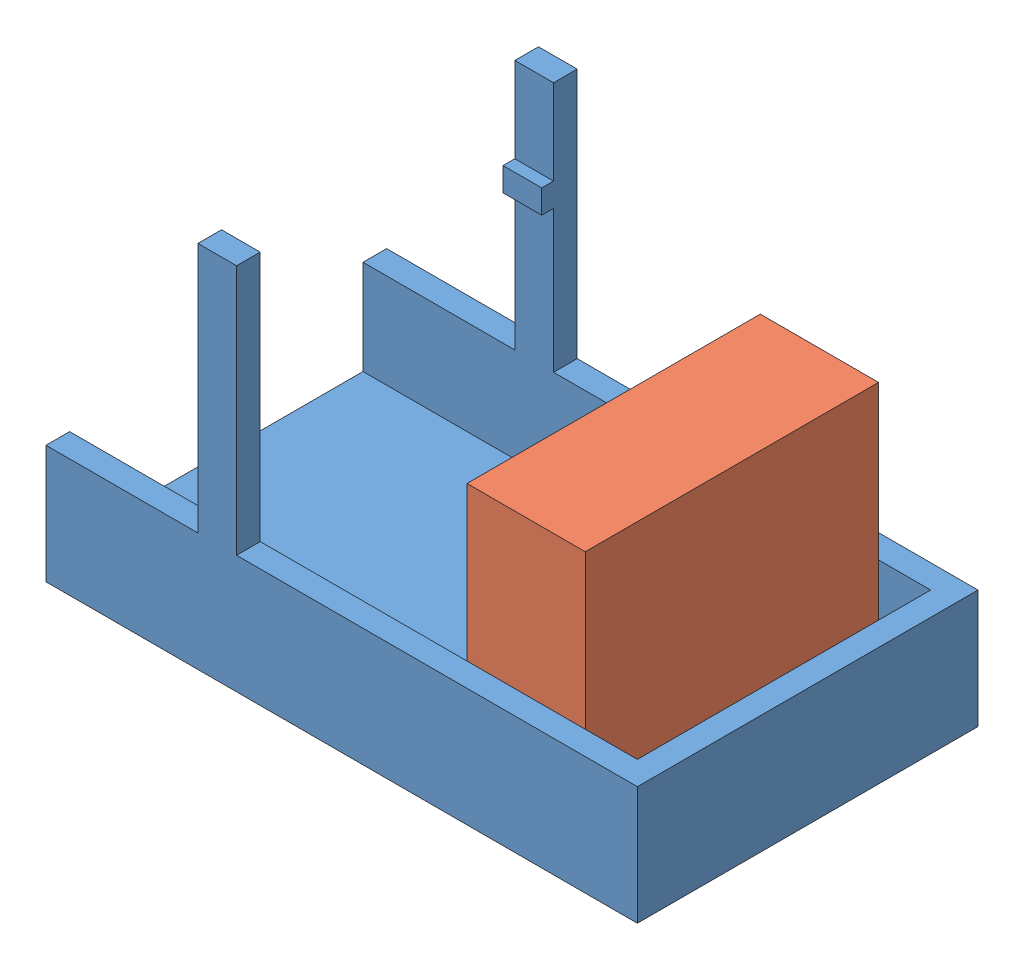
SolidWorks assembly Collision Detection.SLDASM, configuration Default (file format 4400). Lengths in mm.
Overall size (250 156 144).
2 component instances, 2 part files, 2 mates.
Components (placement in the parent):
- Slide-1: Slide.SLDPRT [Default] at origin size (250 156 144)
- block-1: block.SLDPRT [Default] at (192.9698 10 0) size (50 105 124)
Mates (geometry in assembly coordinates):
- Coincident1: coincident anti-aligned: plane of Slide-1 through (0 10 72) normal (0 1 0); plane of block-1 through (167.9698 10 62) normal (0 -1 0)
- Coincident2: coincident anti-aligned: plane of Slide-1 through (0 50 62) normal (0 0 -1); plane of block-1 through (167.9698 115 62) normal (0 0 1)
